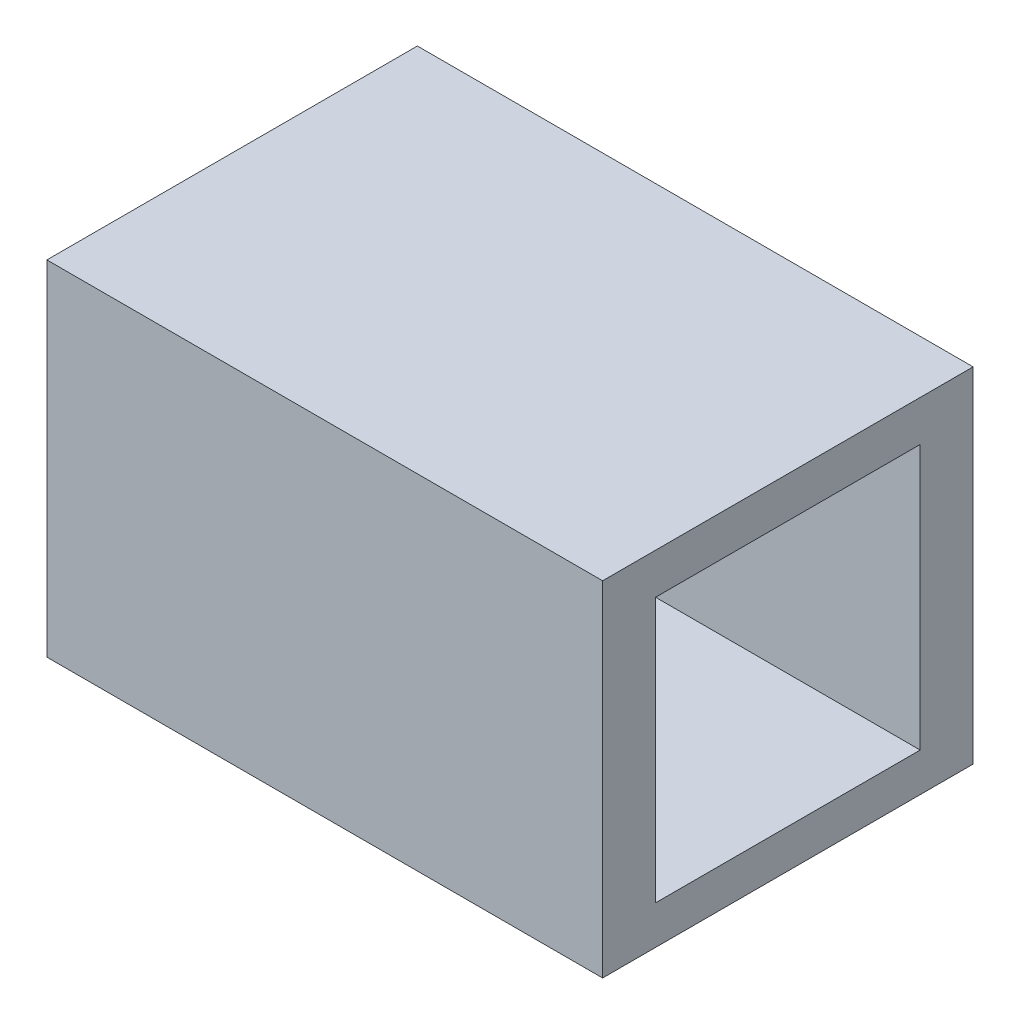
ISO-10303-21;
HEADER;
FILE_DESCRIPTION(('STEP AP214'),'2;1');
FILE_NAME('part.step','',(''),(''),'','','');
FILE_SCHEMA(('AUTOMOTIVE_DESIGN { 1 0 10303 214 1 1 1 1 }'));
ENDSEC;
DATA;
#1=APPLICATION_CONTEXT('core data for automotive mechanical design processes');
#2=APPLICATION_PROTOCOL_DEFINITION('international standard','automotive_design',2000,#1);
#3=PRODUCT_CONTEXT('',#1,'mechanical');
#4=PRODUCT('Part','Part','',(#3));
#5=PRODUCT_RELATED_PRODUCT_CATEGORY('part','',(#4));
#6=PRODUCT_DEFINITION_FORMATION('','',#4);
#7=PRODUCT_DEFINITION_CONTEXT('part definition',#1,'design');
#8=PRODUCT_DEFINITION('design','',#6,#7);
#9=PRODUCT_DEFINITION_SHAPE('','',#8);
#10=(LENGTH_UNIT() NAMED_UNIT(*) SI_UNIT(.MILLI.,.METRE.));
#11=(NAMED_UNIT(*) PLANE_ANGLE_UNIT() SI_UNIT($,.RADIAN.));
#12=(NAMED_UNIT(*) SI_UNIT($,.STERADIAN.) SOLID_ANGLE_UNIT());
#13=UNCERTAINTY_MEASURE_WITH_UNIT(LENGTH_MEASURE(1.E-05),#10,'distance_accuracy_value','');
#14=(GEOMETRIC_REPRESENTATION_CONTEXT(3) GLOBAL_UNCERTAINTY_ASSIGNED_CONTEXT((#13)) GLOBAL_UNIT_ASSIGNED_CONTEXT((#10,
#11,#12)) REPRESENTATION_CONTEXT('',''));
#15=CARTESIAN_POINT('',(0.,0.,0.));
#16=DIRECTION('',(0.,0.,1.));
#17=DIRECTION('',(1.,0.,0.));
#18=AXIS2_PLACEMENT_3D('',#15,#16,#17);
#19=CARTESIAN_POINT('',(10.5,6.5,14.));
#20=DIRECTION('',(-1.,0.,0.));
#21=DIRECTION('',(0.,-1.,0.));
#22=AXIS2_PLACEMENT_3D('',#19,#20,#21);
#23=PLANE('',#22);
#24=DIRECTION('',(0.,0.,1.));
#25=VECTOR('',#24,1.);
#26=CARTESIAN_POINT('',(10.5,4.95995653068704,12.));
#27=LINE('',#26,#25);
#28=CARTESIAN_POINT('',(10.5,4.95995653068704,2.));
#29=VERTEX_POINT('',#28);
#30=CARTESIAN_POINT('',(10.5,4.95995653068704,12.));
#31=VERTEX_POINT('',#30);
#32=EDGE_CURVE('E138',#29,#31,#27,.T.);
#33=ORIENTED_EDGE('',*,*,#32,.F.);
#34=DIRECTION('',(0.,1.,0.));
#35=VECTOR('',#34,1.);
#36=CARTESIAN_POINT('',(10.5,-5.04004346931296,2.));
#37=LINE('',#36,#35);
#38=CARTESIAN_POINT('',(10.5,-5.04004346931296,2.));
#39=VERTEX_POINT('',#38);
#40=EDGE_CURVE('E50',#39,#29,#37,.T.);
#41=ORIENTED_EDGE('',*,*,#40,.F.);
#42=DIRECTION('',(0.,0.,-1.));
#43=VECTOR('',#42,1.);
#44=CARTESIAN_POINT('',(10.5,-5.04004346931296,12.));
#45=LINE('',#44,#43);
#46=CARTESIAN_POINT('',(10.5,-5.04004346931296,12.));
#47=VERTEX_POINT('',#46);
#48=EDGE_CURVE('E129',#47,#39,#45,.T.);
#49=ORIENTED_EDGE('',*,*,#48,.F.);
#50=DIRECTION('',(0.,-1.,0.));
#51=VECTOR('',#50,1.);
#52=CARTESIAN_POINT('',(10.5,-5.04004346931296,12.));
#53=LINE('',#52,#51);
#54=EDGE_CURVE('E132',#31,#47,#53,.T.);
#55=ORIENTED_EDGE('',*,*,#54,.F.);
#56=EDGE_LOOP('',(#33,#41,#49,#55));
#57=FACE_BOUND('',#56,.T.);
#58=DIRECTION('',(0.,1.,0.));
#59=VECTOR('',#58,1.);
#60=CARTESIAN_POINT('',(10.5,6.5,0.));
#61=LINE('',#60,#59);
#62=CARTESIAN_POINT('',(10.5,-6.5,0.));
#63=VERTEX_POINT('',#62);
#64=CARTESIAN_POINT('',(10.5,6.5,0.));
#65=VERTEX_POINT('',#64);
#66=EDGE_CURVE('E144',#63,#65,#61,.T.);
#67=ORIENTED_EDGE('',*,*,#66,.T.);
#68=DIRECTION('',(0.,0.,-1.));
#69=VECTOR('',#68,1.);
#70=CARTESIAN_POINT('',(10.5,6.5,14.));
#71=LINE('',#70,#69);
#72=CARTESIAN_POINT('',(10.5,6.5,14.));
#73=VERTEX_POINT('',#72);
#74=EDGE_CURVE('E11',#73,#65,#71,.T.);
#75=ORIENTED_EDGE('',*,*,#74,.F.);
#76=DIRECTION('',(0.,1.,0.));
#77=VECTOR('',#76,1.);
#78=CARTESIAN_POINT('',(10.5,6.5,14.));
#79=LINE('',#78,#77);
#80=CARTESIAN_POINT('',(10.5,-6.5,14.));
#81=VERTEX_POINT('',#80);
#82=EDGE_CURVE('E148',#81,#73,#79,.T.);
#83=ORIENTED_EDGE('',*,*,#82,.F.);
#84=DIRECTION('',(0.,0.,-1.));
#85=VECTOR('',#84,1.);
#86=CARTESIAN_POINT('',(10.5,-6.5,14.));
#87=LINE('',#86,#85);
#88=EDGE_CURVE('E154',#81,#63,#87,.T.);
#89=ORIENTED_EDGE('',*,*,#88,.T.);
#90=EDGE_LOOP('',(#67,#75,#83,#89));
#91=FACE_BOUND('',#90,.T.);
#92=ADVANCED_FACE('F36',(#57,#91),#23,.F.);
#93=CARTESIAN_POINT('',(-10.5,6.5,14.));
#94=DIRECTION('',(0.,-1.,0.));
#95=DIRECTION('',(0.,0.,-1.));
#96=AXIS2_PLACEMENT_3D('',#93,#94,#95);
#97=PLANE('',#96);
#98=DIRECTION('',(-1.,0.,0.));
#99=VECTOR('',#98,1.);
#100=CARTESIAN_POINT('',(-10.5,6.5,0.));
#101=LINE('',#100,#99);
#102=CARTESIAN_POINT('',(-10.5,6.5,0.));
#103=VERTEX_POINT('',#102);
#104=EDGE_CURVE('E157',#65,#103,#101,.T.);
#105=ORIENTED_EDGE('',*,*,#104,.T.);
#106=DIRECTION('',(0.,0.,-1.));
#107=VECTOR('',#106,1.);
#108=CARTESIAN_POINT('',(-10.5,6.5,14.));
#109=LINE('',#108,#107);
#110=CARTESIAN_POINT('',(-10.5,6.5,14.));
#111=VERTEX_POINT('',#110);
#112=EDGE_CURVE('E43',#111,#103,#109,.T.);
#113=ORIENTED_EDGE('',*,*,#112,.F.);
#114=DIRECTION('',(-1.,0.,0.));
#115=VECTOR('',#114,1.);
#116=CARTESIAN_POINT('',(-10.5,6.5,14.));
#117=LINE('',#116,#115);
#118=EDGE_CURVE('E87',#73,#111,#117,.T.);
#119=ORIENTED_EDGE('',*,*,#118,.F.);
#120=ORIENTED_EDGE('',*,*,#74,.T.);
#121=EDGE_LOOP('',(#105,#113,#119,#120));
#122=FACE_BOUND('',#121,.T.);
#123=ADVANCED_FACE('F185',(#122),#97,.F.);
#124=CARTESIAN_POINT('',(-10.5,6.5,14.));
#125=DIRECTION('',(1.,0.,0.));
#126=DIRECTION('',(0.,1.,0.));
#127=AXIS2_PLACEMENT_3D('',#124,#125,#126);
#128=PLANE('',#127);
#129=DIRECTION('',(0.,-1.,0.));
#130=VECTOR('',#129,1.);
#131=CARTESIAN_POINT('',(-10.5,6.5,0.));
#132=LINE('',#131,#130);
#133=CARTESIAN_POINT('',(-10.5,-6.5,0.));
#134=VERTEX_POINT('',#133);
#135=EDGE_CURVE('E159',#103,#134,#132,.T.);
#136=ORIENTED_EDGE('',*,*,#135,.T.);
#137=DIRECTION('',(0.,0.,-1.));
#138=VECTOR('',#137,1.);
#139=CARTESIAN_POINT('',(-10.5,-6.5,14.));
#140=LINE('',#139,#138);
#141=CARTESIAN_POINT('',(-10.5,-6.5,14.));
#142=VERTEX_POINT('',#141);
#143=EDGE_CURVE('E163',#142,#134,#140,.T.);
#144=ORIENTED_EDGE('',*,*,#143,.F.);
#145=DIRECTION('',(0.,-1.,0.));
#146=VECTOR('',#145,1.);
#147=CARTESIAN_POINT('',(-10.5,6.5,14.));
#148=LINE('',#147,#146);
#149=EDGE_CURVE('E151',#111,#142,#148,.T.);
#150=ORIENTED_EDGE('',*,*,#149,.F.);
#151=ORIENTED_EDGE('',*,*,#112,.T.);
#152=EDGE_LOOP('',(#136,#144,#150,#151));
#153=FACE_BOUND('',#152,.T.);
#154=ADVANCED_FACE('F168',(#153),#128,.F.);
#155=CARTESIAN_POINT('',(-10.5,-6.5,14.));
#156=DIRECTION('',(0.,1.,0.));
#157=DIRECTION('',(0.,0.,1.));
#158=AXIS2_PLACEMENT_3D('',#155,#156,#157);
#159=PLANE('',#158);
#160=DIRECTION('',(1.,0.,0.));
#161=VECTOR('',#160,1.);
#162=CARTESIAN_POINT('',(-10.5,-6.5,0.));
#163=LINE('',#162,#161);
#164=EDGE_CURVE('E80',#134,#63,#163,.T.);
#165=ORIENTED_EDGE('',*,*,#164,.T.);
#166=ORIENTED_EDGE('',*,*,#88,.F.);
#167=DIRECTION('',(1.,0.,0.));
#168=VECTOR('',#167,1.);
#169=CARTESIAN_POINT('',(-10.5,-6.5,14.));
#170=LINE('',#169,#168);
#171=EDGE_CURVE('E59',#142,#81,#170,.T.);
#172=ORIENTED_EDGE('',*,*,#171,.F.);
#173=ORIENTED_EDGE('',*,*,#143,.T.);
#174=EDGE_LOOP('',(#165,#166,#172,#173));
#175=FACE_BOUND('',#174,.T.);
#176=ADVANCED_FACE('F176',(#175),#159,.F.);
#177=CARTESIAN_POINT('',(0.,0.,14.));
#178=DIRECTION('',(0.,0.,1.));
#179=DIRECTION('',(1.,0.,0.));
#180=AXIS2_PLACEMENT_3D('',#177,#178,#179);
#181=PLANE('',#180);
#182=ORIENTED_EDGE('',*,*,#82,.T.);
#183=ORIENTED_EDGE('',*,*,#118,.T.);
#184=ORIENTED_EDGE('',*,*,#149,.T.);
#185=ORIENTED_EDGE('',*,*,#171,.T.);
#186=EDGE_LOOP('',(#182,#183,#184,#185));
#187=FACE_BOUND('',#186,.T.);
#188=ADVANCED_FACE('F178',(#187),#181,.T.);
#189=CARTESIAN_POINT('',(0.,0.,0.));
#190=DIRECTION('',(0.,0.,1.));
#191=DIRECTION('',(1.,0.,0.));
#192=AXIS2_PLACEMENT_3D('',#189,#190,#191);
#193=PLANE('',#192);
#194=ORIENTED_EDGE('',*,*,#66,.F.);
#195=ORIENTED_EDGE('',*,*,#164,.F.);
#196=ORIENTED_EDGE('',*,*,#135,.F.);
#197=ORIENTED_EDGE('',*,*,#104,.F.);
#198=EDGE_LOOP('',(#194,#195,#196,#197));
#199=FACE_BOUND('',#198,.T.);
#200=ADVANCED_FACE('F172',(#199),#193,.F.);
#201=CARTESIAN_POINT('',(-6.5,-5.04004346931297,2.));
#202=DIRECTION('',(0.,0.,-1.));
#203=DIRECTION('',(-1.,0.,0.));
#204=AXIS2_PLACEMENT_3D('',#201,#202,#203);
#205=PLANE('',#204);
#206=ORIENTED_EDGE('',*,*,#40,.T.);
#207=DIRECTION('',(1.,0.,0.));
#208=VECTOR('',#207,1.);
#209=CARTESIAN_POINT('',(-6.5,4.95995653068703,2.));
#210=LINE('',#209,#208);
#211=CARTESIAN_POINT('',(-6.5,4.95995653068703,2.));
#212=VERTEX_POINT('',#211);
#213=EDGE_CURVE('E107',#212,#29,#210,.T.);
#214=ORIENTED_EDGE('',*,*,#213,.F.);
#215=DIRECTION('',(0.,1.,0.));
#216=VECTOR('',#215,1.);
#217=CARTESIAN_POINT('',(-6.5,-5.04004346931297,2.));
#218=LINE('',#217,#216);
#219=CARTESIAN_POINT('',(-6.5,-5.04004346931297,2.));
#220=VERTEX_POINT('',#219);
#221=EDGE_CURVE('E111',#220,#212,#218,.T.);
#222=ORIENTED_EDGE('',*,*,#221,.F.);
#223=DIRECTION('',(1.,0.,0.));
#224=VECTOR('',#223,1.);
#225=CARTESIAN_POINT('',(-6.5,-5.04004346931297,2.));
#226=LINE('',#225,#224);
#227=EDGE_CURVE('E142',#220,#39,#226,.T.);
#228=ORIENTED_EDGE('',*,*,#227,.T.);
#229=EDGE_LOOP('',(#206,#214,#222,#228));
#230=FACE_BOUND('',#229,.T.);
#231=ADVANCED_FACE('F109',(#230),#205,.F.);
#232=CARTESIAN_POINT('',(-6.5,-5.04004346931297,12.));
#233=DIRECTION('',(0.,-1.,0.));
#234=DIRECTION('',(1.,0.,0.));
#235=AXIS2_PLACEMENT_3D('',#232,#233,#234);
#236=PLANE('',#235);
#237=ORIENTED_EDGE('',*,*,#48,.T.);
#238=ORIENTED_EDGE('',*,*,#227,.F.);
#239=DIRECTION('',(0.,0.,-1.));
#240=VECTOR('',#239,1.);
#241=CARTESIAN_POINT('',(-6.5,-5.04004346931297,12.));
#242=LINE('',#241,#240);
#243=CARTESIAN_POINT('',(-6.5,-5.04004346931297,12.));
#244=VERTEX_POINT('',#243);
#245=EDGE_CURVE('E117',#244,#220,#242,.T.);
#246=ORIENTED_EDGE('',*,*,#245,.F.);
#247=DIRECTION('',(1.,0.,0.));
#248=VECTOR('',#247,1.);
#249=CARTESIAN_POINT('',(-6.5,-5.04004346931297,12.));
#250=LINE('',#249,#248);
#251=EDGE_CURVE('E145',#244,#47,#250,.T.);
#252=ORIENTED_EDGE('',*,*,#251,.T.);
#253=EDGE_LOOP('',(#237,#238,#246,#252));
#254=FACE_BOUND('',#253,.T.);
#255=ADVANCED_FACE('F198',(#254),#236,.F.);
#256=CARTESIAN_POINT('',(-6.5,-5.04004346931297,12.));
#257=DIRECTION('',(0.,0.,1.));
#258=DIRECTION('',(1.,0.,0.));
#259=AXIS2_PLACEMENT_3D('',#256,#257,#258);
#260=PLANE('',#259);
#261=ORIENTED_EDGE('',*,*,#54,.T.);
#262=ORIENTED_EDGE('',*,*,#251,.F.);
#263=DIRECTION('',(0.,-1.,0.));
#264=VECTOR('',#263,1.);
#265=CARTESIAN_POINT('',(-6.5,-5.04004346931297,12.));
#266=LINE('',#265,#264);
#267=CARTESIAN_POINT('',(-6.5,4.95995653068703,12.));
#268=VERTEX_POINT('',#267);
#269=EDGE_CURVE('E125',#268,#244,#266,.T.);
#270=ORIENTED_EDGE('',*,*,#269,.F.);
#271=DIRECTION('',(1.,0.,0.));
#272=VECTOR('',#271,1.);
#273=CARTESIAN_POINT('',(-6.5,4.95995653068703,12.));
#274=LINE('',#273,#272);
#275=EDGE_CURVE('E116',#268,#31,#274,.T.);
#276=ORIENTED_EDGE('',*,*,#275,.T.);
#277=EDGE_LOOP('',(#261,#262,#270,#276));
#278=FACE_BOUND('',#277,.T.);
#279=ADVANCED_FACE('F196',(#278),#260,.F.);
#280=CARTESIAN_POINT('',(-6.5,4.95995653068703,12.));
#281=DIRECTION('',(0.,1.,0.));
#282=DIRECTION('',(-1.,0.,0.));
#283=AXIS2_PLACEMENT_3D('',#280,#281,#282);
#284=PLANE('',#283);
#285=ORIENTED_EDGE('',*,*,#32,.T.);
#286=ORIENTED_EDGE('',*,*,#275,.F.);
#287=DIRECTION('',(0.,0.,1.));
#288=VECTOR('',#287,1.);
#289=CARTESIAN_POINT('',(-6.5,4.95995653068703,12.));
#290=LINE('',#289,#288);
#291=EDGE_CURVE('E120',#212,#268,#290,.T.);
#292=ORIENTED_EDGE('',*,*,#291,.F.);
#293=ORIENTED_EDGE('',*,*,#213,.T.);
#294=EDGE_LOOP('',(#285,#286,#292,#293));
#295=FACE_BOUND('',#294,.T.);
#296=ADVANCED_FACE('F121',(#295),#284,.F.);
#297=CARTESIAN_POINT('',(-6.5,0.,0.));
#298=DIRECTION('',(-1.,0.,0.));
#299=DIRECTION('',(0.,-1.,0.));
#300=AXIS2_PLACEMENT_3D('',#297,#298,#299);
#301=PLANE('',#300);
#302=ORIENTED_EDGE('',*,*,#221,.T.);
#303=ORIENTED_EDGE('',*,*,#291,.T.);
#304=ORIENTED_EDGE('',*,*,#269,.T.);
#305=ORIENTED_EDGE('',*,*,#245,.T.);
#306=EDGE_LOOP('',(#302,#303,#304,#305));
#307=FACE_BOUND('',#306,.T.);
#308=ADVANCED_FACE('F127',(#307),#301,.F.);
#309=CLOSED_SHELL('',(#92,#123,#154,#176,#188,#200,#231,#255,#279,#296,#308));
#310=MANIFOLD_SOLID_BREP('B2',#309);
#311=ADVANCED_BREP_SHAPE_REPRESENTATION('',(#18,#310),#14);
#312=SHAPE_DEFINITION_REPRESENTATION(#9,#311);
ENDSEC;
END-ISO-10303-21;
